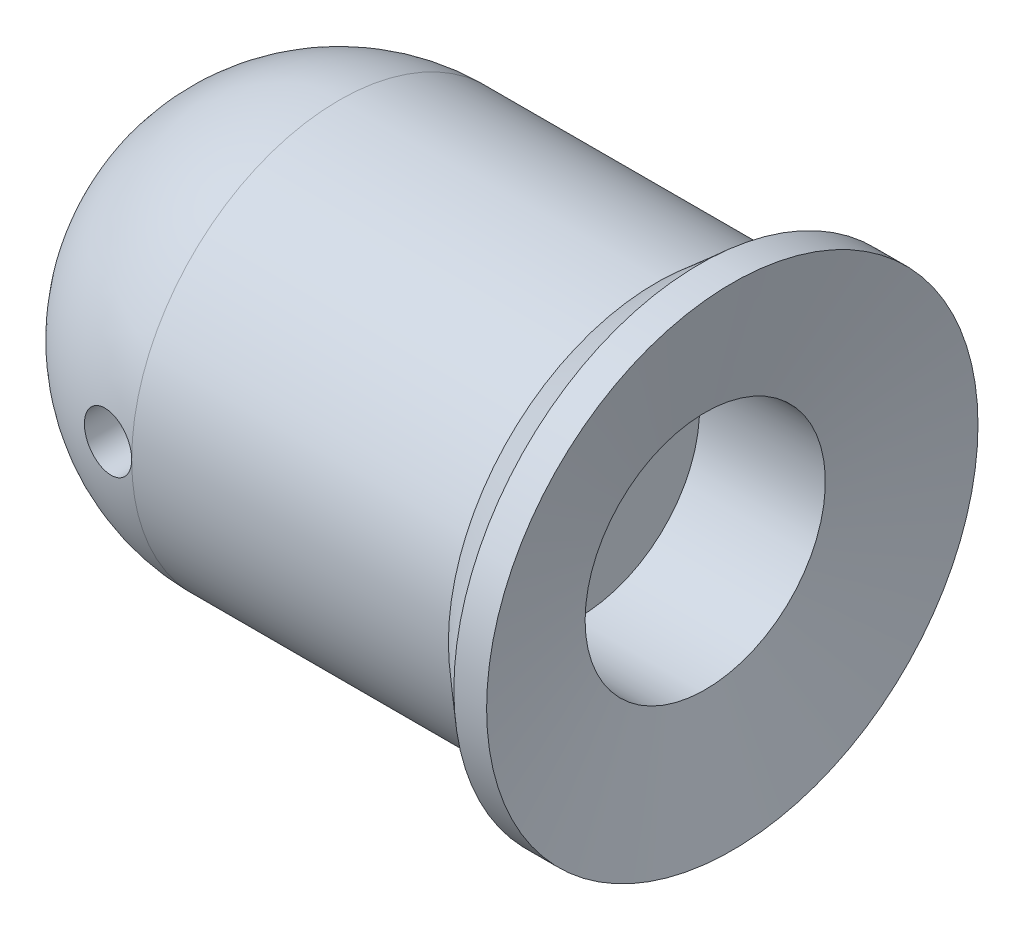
from build123d import *

# Parameters (mm, degrees)
TROU_TARAUD_M101_D           = 8.5
TROU_TARAUD_M101_DEPTH       = 25
TROU_TARAUD_M101_TIP         = 2.553657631
ENL_V_MAT_EXTRU_1_DEPTH      = 49.046852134
ENL_V_MAT_EXTRU_1_DEPTH_BACK = 49.046852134
ESQUISSE4_R                  = 2.5


with BuildPart() as part:
    # Esquisse1 → R_volution1 (revolve)
    with BuildSketch(Plane.XY, mode=Mode.PRIVATE) as r_volution1_sk:
        with BuildLine():
            Line((0, 19), (29, 19))
            Line((29, 19), (33, 22.5))
            Line((33, 22.5), (36, 22.5))
            Line((36, 22.5), (33.52, 11))
            Line((33.52, 11), (22, 11))
            Line((22, 11), (22, 0))
            Line((22, 0), (-19, 0))
            ThreePointArc((-19, 0), (-13.435028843, 13.435028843), (0, 19))
        make_face()
    revolve(r_volution1_sk.sketch.rotate(Axis((0, 0, 0), (1, 0, 0)), 90), axis=Axis((0, 0, 0), (1, 0, 0)))

    # Trou taraud_ M101
    with Locations(Plane(origin=(22, 0, 0), x_dir=(0, 0, -1), z_dir=(1, 0, 0))):
        with Locations((0, 0)):
            Hole(TROU_TARAUD_M101_D / 2, depth=TROU_TARAUD_M101_DEPTH)
            with Locations((0, 0, -(TROU_TARAUD_M101_DEPTH + TROU_TARAUD_M101_TIP / 2))):  # 118° drill point
                Cone(0, TROU_TARAUD_M101_D / 2, TROU_TARAUD_M101_TIP, mode=Mode.SUBTRACT)

    # Esquisse4 → Enl_v. mat.-Extru.1 (cut, two sides: drawn at the far end of the back side and taken through both)
    with BuildSketch(Plane.XY.offset(-ENL_V_MAT_EXTRU_1_DEPTH_BACK)):
        with Locations((-2.5, 0)):
            Circle(ESQUISSE4_R)
    extrude(amount=ENL_V_MAT_EXTRU_1_DEPTH + ENL_V_MAT_EXTRU_1_DEPTH_BACK, mode=Mode.SUBTRACT)


solid = part.part
